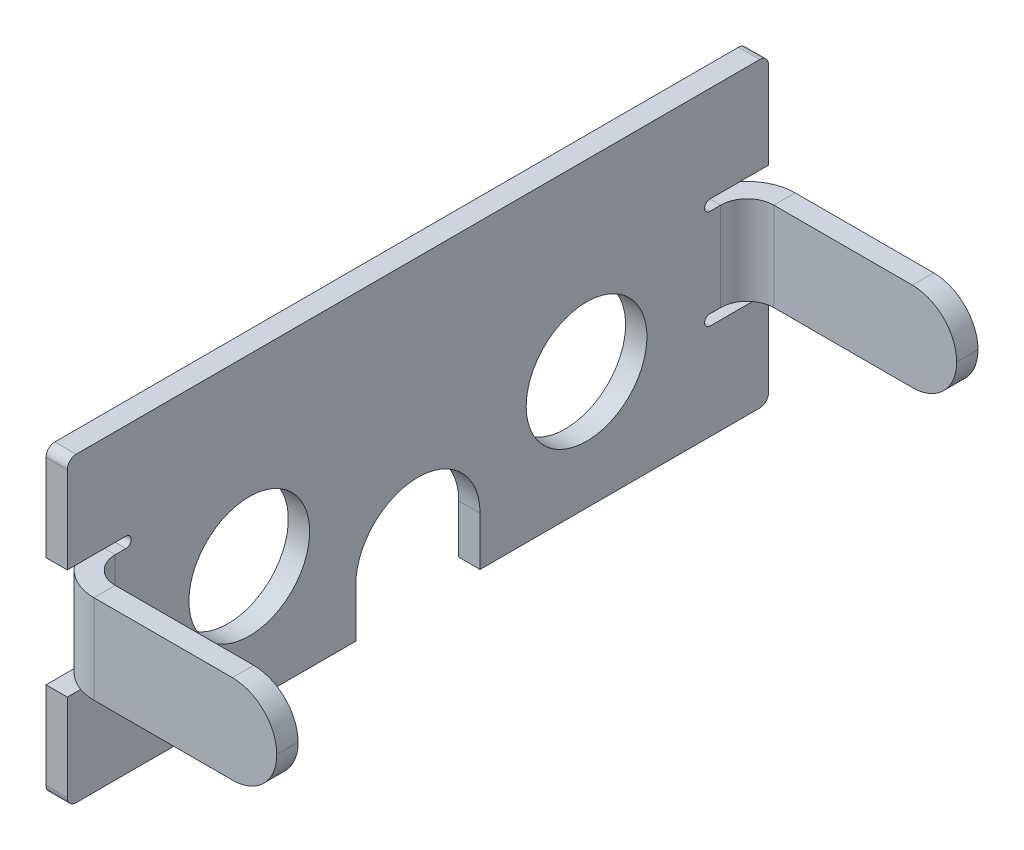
ISO-10303-21;
HEADER;
FILE_DESCRIPTION(('STEP AP214'),'2;1');
FILE_NAME('part.step','',(''),(''),'','','');
FILE_SCHEMA(('AUTOMOTIVE_DESIGN { 1 0 10303 214 1 1 1 1 }'));
ENDSEC;
DATA;
#1=APPLICATION_CONTEXT('core data for automotive mechanical design processes');
#2=APPLICATION_PROTOCOL_DEFINITION('international standard','automotive_design',2000,#1);
#3=PRODUCT_CONTEXT('',#1,'mechanical');
#4=PRODUCT('Part','Part','',(#3));
#5=PRODUCT_RELATED_PRODUCT_CATEGORY('part','',(#4));
#6=PRODUCT_DEFINITION_FORMATION('','',#4);
#7=PRODUCT_DEFINITION_CONTEXT('part definition',#1,'design');
#8=PRODUCT_DEFINITION('design','',#6,#7);
#9=PRODUCT_DEFINITION_SHAPE('','',#8);
#10=(LENGTH_UNIT() NAMED_UNIT(*) SI_UNIT(.MILLI.,.METRE.));
#11=(NAMED_UNIT(*) PLANE_ANGLE_UNIT() SI_UNIT($,.RADIAN.));
#12=(NAMED_UNIT(*) SI_UNIT($,.STERADIAN.) SOLID_ANGLE_UNIT());
#13=UNCERTAINTY_MEASURE_WITH_UNIT(LENGTH_MEASURE(1.E-05),#10,'distance_accuracy_value','');
#14=(GEOMETRIC_REPRESENTATION_CONTEXT(3) GLOBAL_UNCERTAINTY_ASSIGNED_CONTEXT((#13)) GLOBAL_UNIT_ASSIGNED_CONTEXT((#10,
#11,#12)) REPRESENTATION_CONTEXT('',''));
#15=CARTESIAN_POINT('',(0.,0.,0.));
#16=DIRECTION('',(0.,0.,1.));
#17=DIRECTION('',(1.,0.,0.));
#18=AXIS2_PLACEMENT_3D('',#15,#16,#17);
#19=CARTESIAN_POINT('',(-1.2,-8.50000000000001,19.75));
#20=DIRECTION('',(0.,-1.,0.));
#21=DIRECTION('',(0.,0.,-1.));
#22=AXIS2_PLACEMENT_3D('',#19,#20,#21);
#23=PLANE('',#22);
#24=DIRECTION('',(-1.,0.,0.));
#25=VECTOR('',#24,1.);
#26=CARTESIAN_POINT('',(-1.2,-8.50000000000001,3.5));
#27=LINE('',#26,#25);
#28=CARTESIAN_POINT('',(0.,-8.50000000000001,3.5));
#29=VERTEX_POINT('',#28);
#30=CARTESIAN_POINT('',(-1.2,-8.50000000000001,3.5));
#31=VERTEX_POINT('',#30);
#32=EDGE_CURVE('E13',#29,#31,#27,.T.);
#33=ORIENTED_EDGE('',*,*,#32,.F.);
#34=DIRECTION('',(0.,0.,-1.));
#35=VECTOR('',#34,1.);
#36=CARTESIAN_POINT('',(0.,-8.50000000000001,19.75));
#37=LINE('',#36,#35);
#38=CARTESIAN_POINT('',(0.,-8.50000000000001,19.25));
#39=VERTEX_POINT('',#38);
#40=EDGE_CURVE('E578',#39,#29,#37,.T.);
#41=ORIENTED_EDGE('',*,*,#40,.F.);
#42=DIRECTION('',(1.,0.,0.));
#43=VECTOR('',#42,1.);
#44=CARTESIAN_POINT('',(-1.2,-8.50000000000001,19.25));
#45=LINE('',#44,#43);
#46=CARTESIAN_POINT('',(-1.2,-8.50000000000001,19.25));
#47=VERTEX_POINT('',#46);
#48=EDGE_CURVE('E605',#39,#47,#45,.F.);
#49=ORIENTED_EDGE('',*,*,#48,.T.);
#50=DIRECTION('',(0.,0.,-1.));
#51=VECTOR('',#50,1.);
#52=CARTESIAN_POINT('',(-1.2,-8.50000000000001,19.75));
#53=LINE('',#52,#51);
#54=EDGE_CURVE('E565',#47,#31,#53,.T.);
#55=ORIENTED_EDGE('',*,*,#54,.T.);
#56=EDGE_LOOP('',(#33,#41,#49,#55));
#57=FACE_BOUND('',#56,.T.);
#58=ADVANCED_FACE('F76',(#57),#23,.T.);
#59=CARTESIAN_POINT('',(-1.2,0.,0.));
#60=DIRECTION('',(-1.,0.,0.));
#61=DIRECTION('',(0.,0.,1.));
#62=AXIS2_PLACEMENT_3D('',#59,#60,#61);
#63=PLANE('',#62);
#64=DIRECTION('',(0.,1.,0.));
#65=VECTOR('',#64,1.);
#66=CARTESIAN_POINT('',(-1.2,-5.75000000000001,3.5));
#67=LINE('',#66,#65);
#68=CARTESIAN_POINT('',(-1.2,-5.75000000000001,3.5));
#69=VERTEX_POINT('',#68);
#70=EDGE_CURVE('E342',#31,#69,#67,.T.);
#71=ORIENTED_EDGE('',*,*,#70,.F.);
#72=ORIENTED_EDGE('',*,*,#54,.F.);
#73=CARTESIAN_POINT('',(-1.2,-8.00000000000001,19.25));
#74=DIRECTION('',(-1.,0.,0.));
#75=DIRECTION('',(0.,0.,1.));
#76=AXIS2_PLACEMENT_3D('',#73,#74,#75);
#77=CIRCLE('',#76,0.5);
#78=CARTESIAN_POINT('',(-1.2,-8.00000000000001,19.75));
#79=VERTEX_POINT('',#78);
#80=EDGE_CURVE('E625',#47,#79,#77,.T.);
#81=ORIENTED_EDGE('',*,*,#80,.T.);
#82=DIRECTION('',(0.,-1.,0.));
#83=VECTOR('',#82,1.);
#84=CARTESIAN_POINT('',(-1.2,-8.50000000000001,19.75));
#85=LINE('',#84,#83);
#86=CARTESIAN_POINT('',(-1.2,-3.1,19.75));
#87=VERTEX_POINT('',#86);
#88=EDGE_CURVE('E561',#87,#79,#85,.T.);
#89=ORIENTED_EDGE('',*,*,#88,.F.);
#90=DIRECTION('',(0.,0.,-1.));
#91=VECTOR('',#90,1.);
#92=CARTESIAN_POINT('',(-1.2,-3.1,0.));
#93=LINE('',#92,#91);
#94=CARTESIAN_POINT('',(-1.2,-3.1,16.45));
#95=VERTEX_POINT('',#94);
#96=EDGE_CURVE('E553',#87,#95,#93,.T.);
#97=ORIENTED_EDGE('',*,*,#96,.T.);
#98=CARTESIAN_POINT('',(-1.2,-2.8,16.45));
#99=DIRECTION('',(-1.,0.,0.));
#100=DIRECTION('',(0.,0.,1.));
#101=AXIS2_PLACEMENT_3D('',#98,#99,#100);
#102=CIRCLE('',#101,0.3);
#103=CARTESIAN_POINT('',(-1.2,-2.5,16.45));
#104=VERTEX_POINT('',#103);
#105=EDGE_CURVE('E551',#95,#104,#102,.F.);
#106=ORIENTED_EDGE('',*,*,#105,.T.);
#107=DIRECTION('',(0.,0.,1.));
#108=VECTOR('',#107,1.);
#109=CARTESIAN_POINT('',(-1.2,-2.5,0.));
#110=LINE('',#109,#108);
#111=CARTESIAN_POINT('',(-1.20000000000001,-2.5,17.05));
#112=VERTEX_POINT('',#111);
#113=EDGE_CURVE('E548',#104,#112,#110,.T.);
#114=ORIENTED_EDGE('',*,*,#113,.T.);
#115=DIRECTION('',(0.,-1.,0.));
#116=VECTOR('',#115,1.);
#117=CARTESIAN_POINT('',(-1.20000000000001,-2.5,17.05));
#118=LINE('',#117,#116);
#119=CARTESIAN_POINT('',(-1.2,2.5,17.05));
#120=VERTEX_POINT('',#119);
#121=EDGE_CURVE('E484',#112,#120,#118,.F.);
#122=ORIENTED_EDGE('',*,*,#121,.T.);
#123=DIRECTION('',(0.,0.,-1.));
#124=VECTOR('',#123,1.);
#125=CARTESIAN_POINT('',(-1.2,2.5,0.));
#126=LINE('',#125,#124);
#127=CARTESIAN_POINT('',(-1.2,2.5,16.45));
#128=VERTEX_POINT('',#127);
#129=EDGE_CURVE('E546',#120,#128,#126,.T.);
#130=ORIENTED_EDGE('',*,*,#129,.T.);
#131=CARTESIAN_POINT('',(-1.2,2.8,16.45));
#132=DIRECTION('',(-1.,0.,0.));
#133=DIRECTION('',(0.,0.,1.));
#134=AXIS2_PLACEMENT_3D('',#131,#132,#133);
#135=CIRCLE('',#134,0.3);
#136=CARTESIAN_POINT('',(-1.2,3.1,16.45));
#137=VERTEX_POINT('',#136);
#138=EDGE_CURVE('E544',#128,#137,#135,.F.);
#139=ORIENTED_EDGE('',*,*,#138,.T.);
#140=DIRECTION('',(0.,0.,1.));
#141=VECTOR('',#140,1.);
#142=CARTESIAN_POINT('',(-1.2,3.1,0.));
#143=LINE('',#142,#141);
#144=CARTESIAN_POINT('',(-1.2,3.1,19.75));
#145=VERTEX_POINT('',#144);
#146=EDGE_CURVE('E510',#137,#145,#143,.T.);
#147=ORIENTED_EDGE('',*,*,#146,.T.);
#148=CARTESIAN_POINT('',(-1.2,7.99999999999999,19.75));
#149=VERTEX_POINT('',#148);
#150=EDGE_CURVE('E562',#149,#145,#85,.T.);
#151=ORIENTED_EDGE('',*,*,#150,.F.);
#152=CARTESIAN_POINT('',(-1.2,7.99999999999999,19.25));
#153=DIRECTION('',(-1.,0.,0.));
#154=DIRECTION('',(0.,0.,1.));
#155=AXIS2_PLACEMENT_3D('',#152,#153,#154);
#156=CIRCLE('',#155,0.5);
#157=CARTESIAN_POINT('',(-1.2,8.49999999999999,19.25));
#158=VERTEX_POINT('',#157);
#159=EDGE_CURVE('E99',#149,#158,#156,.T.);
#160=ORIENTED_EDGE('',*,*,#159,.T.);
#161=DIRECTION('',(0.,0.,1.));
#162=VECTOR('',#161,1.);
#163=CARTESIAN_POINT('',(-1.2,8.49999999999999,19.75));
#164=LINE('',#163,#162);
#165=CARTESIAN_POINT('',(-1.2,8.49999999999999,-19.25));
#166=VERTEX_POINT('',#165);
#167=EDGE_CURVE('E558',#166,#158,#164,.T.);
#168=ORIENTED_EDGE('',*,*,#167,.F.);
#169=CARTESIAN_POINT('',(-1.2,7.99999999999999,-19.25));
#170=DIRECTION('',(-1.,0.,0.));
#171=DIRECTION('',(0.,0.,1.));
#172=AXIS2_PLACEMENT_3D('',#169,#170,#171);
#173=CIRCLE('',#172,0.5);
#174=CARTESIAN_POINT('',(-1.2,7.99999999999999,-19.75));
#175=VERTEX_POINT('',#174);
#176=EDGE_CURVE('E627',#166,#175,#173,.T.);
#177=ORIENTED_EDGE('',*,*,#176,.T.);
#178=DIRECTION('',(0.,1.,0.));
#179=VECTOR('',#178,1.);
#180=CARTESIAN_POINT('',(-1.2,-8.50000000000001,-19.75));
#181=LINE('',#180,#179);
#182=CARTESIAN_POINT('',(-1.2,3.1,-19.75));
#183=VERTEX_POINT('',#182);
#184=EDGE_CURVE('E559',#183,#175,#181,.T.);
#185=ORIENTED_EDGE('',*,*,#184,.F.);
#186=DIRECTION('',(0.,0.,1.));
#187=VECTOR('',#186,1.);
#188=CARTESIAN_POINT('',(-1.2,3.1,0.));
#189=LINE('',#188,#187);
#190=CARTESIAN_POINT('',(-1.2,3.1,-16.45));
#191=VERTEX_POINT('',#190);
#192=EDGE_CURVE('E447',#183,#191,#189,.T.);
#193=ORIENTED_EDGE('',*,*,#192,.T.);
#194=CARTESIAN_POINT('',(-1.2,2.8,-16.45));
#195=DIRECTION('',(-1.,0.,0.));
#196=DIRECTION('',(0.,0.,1.));
#197=AXIS2_PLACEMENT_3D('',#194,#195,#196);
#198=CIRCLE('',#197,0.3);
#199=CARTESIAN_POINT('',(-1.2,2.5,-16.45));
#200=VERTEX_POINT('',#199);
#201=EDGE_CURVE('E459',#191,#200,#198,.F.);
#202=ORIENTED_EDGE('',*,*,#201,.T.);
#203=DIRECTION('',(0.,0.,-1.));
#204=VECTOR('',#203,1.);
#205=CARTESIAN_POINT('',(-1.2,2.5,0.));
#206=LINE('',#205,#204);
#207=CARTESIAN_POINT('',(-1.20000000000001,2.5,-17.05));
#208=VERTEX_POINT('',#207);
#209=EDGE_CURVE('E456',#200,#208,#206,.T.);
#210=ORIENTED_EDGE('',*,*,#209,.T.);
#211=DIRECTION('',(0.,1.,0.));
#212=VECTOR('',#211,1.);
#213=CARTESIAN_POINT('',(-1.20000000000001,2.5,-17.05));
#214=LINE('',#213,#212);
#215=CARTESIAN_POINT('',(-1.2,-2.5,-17.05));
#216=VERTEX_POINT('',#215);
#217=EDGE_CURVE('E386',#208,#216,#214,.F.);
#218=ORIENTED_EDGE('',*,*,#217,.T.);
#219=DIRECTION('',(0.,0.,1.));
#220=VECTOR('',#219,1.);
#221=CARTESIAN_POINT('',(-1.2,-2.5,0.));
#222=LINE('',#221,#220);
#223=CARTESIAN_POINT('',(-1.2,-2.5,-16.45));
#224=VERTEX_POINT('',#223);
#225=EDGE_CURVE('E453',#216,#224,#222,.T.);
#226=ORIENTED_EDGE('',*,*,#225,.T.);
#227=CARTESIAN_POINT('',(-1.2,-2.8,-16.45));
#228=DIRECTION('',(-1.,0.,0.));
#229=DIRECTION('',(0.,0.,1.));
#230=AXIS2_PLACEMENT_3D('',#227,#228,#229);
#231=CIRCLE('',#230,0.3);
#232=CARTESIAN_POINT('',(-1.2,-3.1,-16.45));
#233=VERTEX_POINT('',#232);
#234=EDGE_CURVE('E450',#224,#233,#231,.F.);
#235=ORIENTED_EDGE('',*,*,#234,.T.);
#236=DIRECTION('',(0.,0.,-1.));
#237=VECTOR('',#236,1.);
#238=CARTESIAN_POINT('',(-1.2,-3.1,0.));
#239=LINE('',#238,#237);
#240=CARTESIAN_POINT('',(-1.2,-3.1,-19.75));
#241=VERTEX_POINT('',#240);
#242=EDGE_CURVE('E412',#233,#241,#239,.T.);
#243=ORIENTED_EDGE('',*,*,#242,.T.);
#244=CARTESIAN_POINT('',(-1.2,-8.00000000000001,-19.75));
#245=VERTEX_POINT('',#244);
#246=EDGE_CURVE('E556',#245,#241,#181,.T.);
#247=ORIENTED_EDGE('',*,*,#246,.F.);
#248=CARTESIAN_POINT('',(-1.2,-8.00000000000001,-19.25));
#249=DIRECTION('',(-1.,0.,0.));
#250=DIRECTION('',(0.,0.,1.));
#251=AXIS2_PLACEMENT_3D('',#248,#249,#250);
#252=CIRCLE('',#251,0.5);
#253=CARTESIAN_POINT('',(-1.2,-8.50000000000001,-19.25));
#254=VERTEX_POINT('',#253);
#255=EDGE_CURVE('E629',#245,#254,#252,.T.);
#256=ORIENTED_EDGE('',*,*,#255,.T.);
#257=CARTESIAN_POINT('',(-1.2,-8.50000000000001,-3.5));
#258=VERTEX_POINT('',#257);
#259=EDGE_CURVE('E564',#258,#254,#53,.T.);
#260=ORIENTED_EDGE('',*,*,#259,.F.);
#261=DIRECTION('',(0.,-1.,0.));
#262=VECTOR('',#261,1.);
#263=CARTESIAN_POINT('',(-1.2,-5.75000000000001,-3.5));
#264=LINE('',#263,#262);
#265=CARTESIAN_POINT('',(-1.2,-5.75000000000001,-3.5));
#266=VERTEX_POINT('',#265);
#267=EDGE_CURVE('E91',#266,#258,#264,.T.);
#268=ORIENTED_EDGE('',*,*,#267,.F.);
#269=CARTESIAN_POINT('',(-1.2,-5.75000000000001,0.));
#270=DIRECTION('',(-1.,0.,0.));
#271=DIRECTION('',(0.,0.,1.));
#272=AXIS2_PLACEMENT_3D('',#269,#270,#271);
#273=CIRCLE('',#272,3.5);
#274=EDGE_CURVE('E330',#69,#266,#273,.T.);
#275=ORIENTED_EDGE('',*,*,#274,.F.);
#276=EDGE_LOOP('',(#71,#72,#81,#89,#97,#106,#114,#122,#130,#139,#147,#151,#160,#168,#177,#185,
#193,#202,#210,#218,#226,#235,#243,#247,#256,#260,#268,#275));
#277=FACE_BOUND('',#276,.T.);
#278=CARTESIAN_POINT('',(-1.2,-1.84493489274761,9.5));
#279=DIRECTION('',(-1.,0.,0.));
#280=DIRECTION('',(0.,0.,1.));
#281=AXIS2_PLACEMENT_3D('',#278,#279,#280);
#282=CIRCLE('',#281,3.4);
#283=CARTESIAN_POINT('',(-1.2,-1.84493489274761,12.9));
#284=VERTEX_POINT('',#283);
#285=EDGE_CURVE('E349',#284,#284,#282,.T.);
#286=ORIENTED_EDGE('',*,*,#285,.F.);
#287=EDGE_LOOP('',(#286));
#288=FACE_BOUND('',#287,.T.);
#289=CARTESIAN_POINT('',(-1.2,-1.84493489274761,-9.5));
#290=DIRECTION('',(-1.,0.,0.));
#291=DIRECTION('',(0.,0.,1.));
#292=AXIS2_PLACEMENT_3D('',#289,#290,#291);
#293=CIRCLE('',#292,3.4);
#294=CARTESIAN_POINT('',(-1.2,-1.84493489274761,-6.1));
#295=VERTEX_POINT('',#294);
#296=EDGE_CURVE('E354',#295,#295,#293,.T.);
#297=ORIENTED_EDGE('',*,*,#296,.F.);
#298=EDGE_LOOP('',(#297));
#299=FACE_BOUND('',#298,.T.);
#300=ADVANCED_FACE('F651',(#277,#288,#299),#63,.T.);
#301=CARTESIAN_POINT('',(0.,0.,0.));
#302=DIRECTION('',(-1.,0.,0.));
#303=DIRECTION('',(0.,0.,1.));
#304=AXIS2_PLACEMENT_3D('',#301,#302,#303);
#305=PLANE('',#304);
#306=CARTESIAN_POINT('',(0.,-1.84493489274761,9.5));
#307=DIRECTION('',(-1.,0.,0.));
#308=DIRECTION('',(0.,0.,1.));
#309=AXIS2_PLACEMENT_3D('',#306,#307,#308);
#310=CIRCLE('',#309,3.4);
#311=CARTESIAN_POINT('',(0.,-1.84493489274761,12.9));
#312=VERTEX_POINT('',#311);
#313=EDGE_CURVE('E351',#312,#312,#310,.T.);
#314=ORIENTED_EDGE('',*,*,#313,.T.);
#315=EDGE_LOOP('',(#314));
#316=FACE_BOUND('',#315,.T.);
#317=CARTESIAN_POINT('',(0.,-1.84493489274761,-9.5));
#318=DIRECTION('',(-1.,0.,0.));
#319=DIRECTION('',(0.,0.,1.));
#320=AXIS2_PLACEMENT_3D('',#317,#318,#319);
#321=CIRCLE('',#320,3.4);
#322=CARTESIAN_POINT('',(0.,-1.84493489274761,-6.1));
#323=VERTEX_POINT('',#322);
#324=EDGE_CURVE('E357',#323,#323,#321,.T.);
#325=ORIENTED_EDGE('',*,*,#324,.T.);
#326=EDGE_LOOP('',(#325));
#327=FACE_BOUND('',#326,.T.);
#328=ORIENTED_EDGE('',*,*,#40,.T.);
#329=DIRECTION('',(0.,1.,0.));
#330=VECTOR('',#329,1.);
#331=CARTESIAN_POINT('',(0.,-5.75000000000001,3.5));
#332=LINE('',#331,#330);
#333=CARTESIAN_POINT('',(0.,-5.75000000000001,3.5));
#334=VERTEX_POINT('',#333);
#335=EDGE_CURVE('E332',#29,#334,#332,.T.);
#336=ORIENTED_EDGE('',*,*,#335,.T.);
#337=CARTESIAN_POINT('',(0.,-5.75000000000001,0.));
#338=DIRECTION('',(-1.,0.,0.));
#339=DIRECTION('',(0.,0.,1.));
#340=AXIS2_PLACEMENT_3D('',#337,#338,#339);
#341=CIRCLE('',#340,3.5);
#342=CARTESIAN_POINT('',(0.,-5.75000000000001,-3.5));
#343=VERTEX_POINT('',#342);
#344=EDGE_CURVE('E327',#334,#343,#341,.T.);
#345=ORIENTED_EDGE('',*,*,#344,.T.);
#346=DIRECTION('',(0.,-1.,0.));
#347=VECTOR('',#346,1.);
#348=CARTESIAN_POINT('',(0.,-5.75000000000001,-3.5));
#349=LINE('',#348,#347);
#350=CARTESIAN_POINT('',(0.,-8.50000000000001,-3.5));
#351=VERTEX_POINT('',#350);
#352=EDGE_CURVE('E335',#343,#351,#349,.T.);
#353=ORIENTED_EDGE('',*,*,#352,.T.);
#354=CARTESIAN_POINT('',(0.,-8.50000000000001,-19.25));
#355=VERTEX_POINT('',#354);
#356=EDGE_CURVE('E577',#351,#355,#37,.T.);
#357=ORIENTED_EDGE('',*,*,#356,.T.);
#358=CARTESIAN_POINT('',(0.,-8.00000000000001,-19.25));
#359=DIRECTION('',(-1.,0.,0.));
#360=DIRECTION('',(0.,0.,1.));
#361=AXIS2_PLACEMENT_3D('',#358,#359,#360);
#362=CIRCLE('',#361,0.5);
#363=CARTESIAN_POINT('',(0.,-8.00000000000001,-19.75));
#364=VERTEX_POINT('',#363);
#365=EDGE_CURVE('E620',#355,#364,#362,.F.);
#366=ORIENTED_EDGE('',*,*,#365,.T.);
#367=DIRECTION('',(0.,1.,0.));
#368=VECTOR('',#367,1.);
#369=CARTESIAN_POINT('',(0.,-8.50000000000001,-19.75));
#370=LINE('',#369,#368);
#371=CARTESIAN_POINT('',(0.,-3.1,-19.75));
#372=VERTEX_POINT('',#371);
#373=EDGE_CURVE('E569',#364,#372,#370,.T.);
#374=ORIENTED_EDGE('',*,*,#373,.T.);
#375=DIRECTION('',(0.,0.,-1.));
#376=VECTOR('',#375,1.);
#377=CARTESIAN_POINT('',(0.,-3.1,-16.45));
#378=LINE('',#377,#376);
#379=CARTESIAN_POINT('',(0.,-3.1,-16.45));
#380=VERTEX_POINT('',#379);
#381=EDGE_CURVE('E429',#380,#372,#378,.T.);
#382=ORIENTED_EDGE('',*,*,#381,.F.);
#383=CARTESIAN_POINT('',(0.,-2.8,-16.45));
#384=DIRECTION('',(1.,0.,0.));
#385=DIRECTION('',(0.,0.,-1.));
#386=AXIS2_PLACEMENT_3D('',#383,#384,#385);
#387=CIRCLE('',#386,0.3);
#388=CARTESIAN_POINT('',(0.,-2.5,-16.45));
#389=VERTEX_POINT('',#388);
#390=EDGE_CURVE('E425',#389,#380,#387,.T.);
#391=ORIENTED_EDGE('',*,*,#390,.F.);
#392=DIRECTION('',(0.,0.,1.));
#393=VECTOR('',#392,1.);
#394=CARTESIAN_POINT('',(0.,-2.5,-17.05));
#395=LINE('',#394,#393);
#396=CARTESIAN_POINT('',(0.,-2.5,-17.05));
#397=VERTEX_POINT('',#396);
#398=EDGE_CURVE('E422',#397,#389,#395,.T.);
#399=ORIENTED_EDGE('',*,*,#398,.F.);
#400=DIRECTION('',(0.,1.,0.));
#401=VECTOR('',#400,1.);
#402=CARTESIAN_POINT('',(0.,2.5,-17.05));
#403=LINE('',#402,#401);
#404=CARTESIAN_POINT('',(0.,2.5,-17.05));
#405=VERTEX_POINT('',#404);
#406=EDGE_CURVE('E399',#405,#397,#403,.F.);
#407=ORIENTED_EDGE('',*,*,#406,.F.);
#408=DIRECTION('',(0.,0.,-1.));
#409=VECTOR('',#408,1.);
#410=CARTESIAN_POINT('',(0.,2.5,-16.45));
#411=LINE('',#410,#409);
#412=CARTESIAN_POINT('',(0.,2.5,-16.45));
#413=VERTEX_POINT('',#412);
#414=EDGE_CURVE('E418',#413,#405,#411,.T.);
#415=ORIENTED_EDGE('',*,*,#414,.F.);
#416=CARTESIAN_POINT('',(0.,2.8,-16.45));
#417=DIRECTION('',(1.,0.,0.));
#418=DIRECTION('',(0.,0.,-1.));
#419=AXIS2_PLACEMENT_3D('',#416,#417,#418);
#420=CIRCLE('',#419,0.3);
#421=CARTESIAN_POINT('',(0.,3.1,-16.45));
#422=VERTEX_POINT('',#421);
#423=EDGE_CURVE('E414',#422,#413,#420,.T.);
#424=ORIENTED_EDGE('',*,*,#423,.F.);
#425=DIRECTION('',(0.,0.,1.));
#426=VECTOR('',#425,1.);
#427=CARTESIAN_POINT('',(0.,3.1,-19.75));
#428=LINE('',#427,#426);
#429=CARTESIAN_POINT('',(0.,3.1,-19.75));
#430=VERTEX_POINT('',#429);
#431=EDGE_CURVE('E409',#430,#422,#428,.T.);
#432=ORIENTED_EDGE('',*,*,#431,.F.);
#433=CARTESIAN_POINT('',(0.,7.99999999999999,-19.75));
#434=VERTEX_POINT('',#433);
#435=EDGE_CURVE('E555',#430,#434,#370,.T.);
#436=ORIENTED_EDGE('',*,*,#435,.T.);
#437=CARTESIAN_POINT('',(0.,7.99999999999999,-19.25));
#438=DIRECTION('',(-1.,0.,0.));
#439=DIRECTION('',(0.,0.,1.));
#440=AXIS2_PLACEMENT_3D('',#437,#438,#439);
#441=CIRCLE('',#440,0.5);
#442=CARTESIAN_POINT('',(0.,8.49999999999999,-19.25));
#443=VERTEX_POINT('',#442);
#444=EDGE_CURVE('E618',#434,#443,#441,.F.);
#445=ORIENTED_EDGE('',*,*,#444,.T.);
#446=DIRECTION('',(0.,0.,1.));
#447=VECTOR('',#446,1.);
#448=CARTESIAN_POINT('',(0.,8.49999999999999,19.75));
#449=LINE('',#448,#447);
#450=CARTESIAN_POINT('',(0.,8.49999999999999,19.25));
#451=VERTEX_POINT('',#450);
#452=EDGE_CURVE('E571',#443,#451,#449,.T.);
#453=ORIENTED_EDGE('',*,*,#452,.T.);
#454=CARTESIAN_POINT('',(0.,7.99999999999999,19.25));
#455=DIRECTION('',(-1.,0.,0.));
#456=DIRECTION('',(0.,0.,1.));
#457=AXIS2_PLACEMENT_3D('',#454,#455,#456);
#458=CIRCLE('',#457,0.5);
#459=CARTESIAN_POINT('',(0.,7.99999999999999,19.75));
#460=VERTEX_POINT('',#459);
#461=EDGE_CURVE('E614',#451,#460,#458,.F.);
#462=ORIENTED_EDGE('',*,*,#461,.T.);
#463=DIRECTION('',(0.,-1.,0.));
#464=VECTOR('',#463,1.);
#465=CARTESIAN_POINT('',(0.,-8.50000000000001,19.75));
#466=LINE('',#465,#464);
#467=CARTESIAN_POINT('',(0.,3.1,19.75));
#468=VERTEX_POINT('',#467);
#469=EDGE_CURVE('E575',#460,#468,#466,.T.);
#470=ORIENTED_EDGE('',*,*,#469,.T.);
#471=DIRECTION('',(0.,0.,1.));
#472=VECTOR('',#471,1.);
#473=CARTESIAN_POINT('',(0.,3.1,16.45));
#474=LINE('',#473,#472);
#475=CARTESIAN_POINT('',(0.,3.1,16.45));
#476=VERTEX_POINT('',#475);
#477=EDGE_CURVE('E527',#476,#468,#474,.T.);
#478=ORIENTED_EDGE('',*,*,#477,.F.);
#479=CARTESIAN_POINT('',(0.,2.8,16.45));
#480=DIRECTION('',(1.,0.,0.));
#481=DIRECTION('',(0.,0.,-1.));
#482=AXIS2_PLACEMENT_3D('',#479,#480,#481);
#483=CIRCLE('',#482,0.3);
#484=CARTESIAN_POINT('',(0.,2.5,16.45));
#485=VERTEX_POINT('',#484);
#486=EDGE_CURVE('E523',#485,#476,#483,.T.);
#487=ORIENTED_EDGE('',*,*,#486,.F.);
#488=DIRECTION('',(0.,0.,-1.));
#489=VECTOR('',#488,1.);
#490=CARTESIAN_POINT('',(0.,2.5,17.05));
#491=LINE('',#490,#489);
#492=CARTESIAN_POINT('',(0.,2.5,17.05));
#493=VERTEX_POINT('',#492);
#494=EDGE_CURVE('E520',#493,#485,#491,.T.);
#495=ORIENTED_EDGE('',*,*,#494,.F.);
#496=DIRECTION('',(0.,-1.,0.));
#497=VECTOR('',#496,1.);
#498=CARTESIAN_POINT('',(0.,-2.5,17.05));
#499=LINE('',#498,#497);
#500=CARTESIAN_POINT('',(0.,-2.5,17.05));
#501=VERTEX_POINT('',#500);
#502=EDGE_CURVE('E497',#501,#493,#499,.F.);
#503=ORIENTED_EDGE('',*,*,#502,.F.);
#504=DIRECTION('',(0.,0.,1.));
#505=VECTOR('',#504,1.);
#506=CARTESIAN_POINT('',(0.,-2.5,16.45));
#507=LINE('',#506,#505);
#508=CARTESIAN_POINT('',(0.,-2.5,16.45));
#509=VERTEX_POINT('',#508);
#510=EDGE_CURVE('E516',#509,#501,#507,.T.);
#511=ORIENTED_EDGE('',*,*,#510,.F.);
#512=CARTESIAN_POINT('',(0.,-2.8,16.45));
#513=DIRECTION('',(1.,0.,0.));
#514=DIRECTION('',(0.,0.,-1.));
#515=AXIS2_PLACEMENT_3D('',#512,#513,#514);
#516=CIRCLE('',#515,0.3);
#517=CARTESIAN_POINT('',(0.,-3.1,16.45));
#518=VERTEX_POINT('',#517);
#519=EDGE_CURVE('E512',#518,#509,#516,.T.);
#520=ORIENTED_EDGE('',*,*,#519,.F.);
#521=DIRECTION('',(0.,0.,-1.));
#522=VECTOR('',#521,1.);
#523=CARTESIAN_POINT('',(0.,-3.1,19.75));
#524=LINE('',#523,#522);
#525=CARTESIAN_POINT('',(0.,-3.1,19.75));
#526=VERTEX_POINT('',#525);
#527=EDGE_CURVE('E507',#526,#518,#524,.T.);
#528=ORIENTED_EDGE('',*,*,#527,.F.);
#529=CARTESIAN_POINT('',(0.,-8.00000000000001,19.75));
#530=VERTEX_POINT('',#529);
#531=EDGE_CURVE('E574',#526,#530,#466,.T.);
#532=ORIENTED_EDGE('',*,*,#531,.T.);
#533=CARTESIAN_POINT('',(0.,-8.00000000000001,19.25));
#534=DIRECTION('',(-1.,0.,0.));
#535=DIRECTION('',(0.,0.,1.));
#536=AXIS2_PLACEMENT_3D('',#533,#534,#535);
#537=CIRCLE('',#536,0.5);
#538=EDGE_CURVE('E616',#530,#39,#537,.F.);
#539=ORIENTED_EDGE('',*,*,#538,.T.);
#540=EDGE_LOOP('',(#328,#336,#345,#353,#357,#366,#374,#382,#391,#399,#407,#415,#424,#432,#436,
#445,#453,#462,#470,#478,#487,#495,#503,#511,#520,#528,#532,#539));
#541=FACE_BOUND('',#540,.T.);
#542=ADVANCED_FACE('F341',(#316,#327,#541),#305,.F.);
#543=CARTESIAN_POINT('',(-1.2,-8.50000000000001,-19.75));
#544=DIRECTION('',(0.,0.,-1.));
#545=DIRECTION('',(-1.,0.,0.));
#546=AXIS2_PLACEMENT_3D('',#543,#544,#545);
#547=PLANE('',#546);
#548=ORIENTED_EDGE('',*,*,#184,.T.);
#549=DIRECTION('',(1.,0.,0.));
#550=VECTOR('',#549,1.);
#551=CARTESIAN_POINT('',(-1.2,7.99999999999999,-19.75));
#552=LINE('',#551,#550);
#553=EDGE_CURVE('E632',#175,#434,#552,.T.);
#554=ORIENTED_EDGE('',*,*,#553,.T.);
#555=ORIENTED_EDGE('',*,*,#435,.F.);
#556=DIRECTION('',(-1.,0.,0.));
#557=VECTOR('',#556,1.);
#558=CARTESIAN_POINT('',(0.,3.1,-19.75));
#559=LINE('',#558,#557);
#560=EDGE_CURVE('E413',#430,#183,#559,.T.);
#561=ORIENTED_EDGE('',*,*,#560,.T.);
#562=EDGE_LOOP('',(#548,#554,#555,#561));
#563=FACE_BOUND('',#562,.T.);
#564=ADVANCED_FACE('F668',(#563),#547,.T.);
#565=ORIENTED_EDGE('',*,*,#373,.F.);
#566=DIRECTION('',(1.,0.,0.));
#567=VECTOR('',#566,1.);
#568=CARTESIAN_POINT('',(-1.2,-8.00000000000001,-19.75));
#569=LINE('',#568,#567);
#570=EDGE_CURVE('E622',#364,#245,#569,.F.);
#571=ORIENTED_EDGE('',*,*,#570,.T.);
#572=ORIENTED_EDGE('',*,*,#246,.T.);
#573=DIRECTION('',(-1.,0.,0.));
#574=VECTOR('',#573,1.);
#575=CARTESIAN_POINT('',(0.,-3.1,-19.75));
#576=LINE('',#575,#574);
#577=EDGE_CURVE('E432',#372,#241,#576,.T.);
#578=ORIENTED_EDGE('',*,*,#577,.F.);
#579=EDGE_LOOP('',(#565,#571,#572,#578));
#580=FACE_BOUND('',#579,.T.);
#581=ADVANCED_FACE('F731',(#580),#547,.T.);
#582=CARTESIAN_POINT('',(-1.2,-8.50000000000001,19.75));
#583=DIRECTION('',(0.,0.,1.));
#584=DIRECTION('',(1.,0.,0.));
#585=AXIS2_PLACEMENT_3D('',#582,#583,#584);
#586=PLANE('',#585);
#587=ORIENTED_EDGE('',*,*,#88,.T.);
#588=DIRECTION('',(1.,0.,0.));
#589=VECTOR('',#588,1.);
#590=CARTESIAN_POINT('',(-1.2,-8.00000000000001,19.75));
#591=LINE('',#590,#589);
#592=EDGE_CURVE('E640',#79,#530,#591,.T.);
#593=ORIENTED_EDGE('',*,*,#592,.T.);
#594=ORIENTED_EDGE('',*,*,#531,.F.);
#595=DIRECTION('',(-1.,0.,0.));
#596=VECTOR('',#595,1.);
#597=CARTESIAN_POINT('',(0.,-3.1,19.75));
#598=LINE('',#597,#596);
#599=EDGE_CURVE('E511',#526,#87,#598,.T.);
#600=ORIENTED_EDGE('',*,*,#599,.T.);
#601=EDGE_LOOP('',(#587,#593,#594,#600));
#602=FACE_BOUND('',#601,.T.);
#603=ADVANCED_FACE('F748',(#602),#586,.T.);
#604=ORIENTED_EDGE('',*,*,#469,.F.);
#605=DIRECTION('',(1.,0.,0.));
#606=VECTOR('',#605,1.);
#607=CARTESIAN_POINT('',(-1.2,7.99999999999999,19.75));
#608=LINE('',#607,#606);
#609=EDGE_CURVE('E643',#460,#149,#608,.F.);
#610=ORIENTED_EDGE('',*,*,#609,.T.);
#611=ORIENTED_EDGE('',*,*,#150,.T.);
#612=DIRECTION('',(-1.,0.,0.));
#613=VECTOR('',#612,1.);
#614=CARTESIAN_POINT('',(0.,3.1,19.75));
#615=LINE('',#614,#613);
#616=EDGE_CURVE('E530',#468,#145,#615,.T.);
#617=ORIENTED_EDGE('',*,*,#616,.F.);
#618=EDGE_LOOP('',(#604,#610,#611,#617));
#619=FACE_BOUND('',#618,.T.);
#620=ADVANCED_FACE('F647',(#619),#586,.T.);
#621=DIRECTION('',(1.,0.,0.));
#622=VECTOR('',#621,1.);
#623=CARTESIAN_POINT('',(-1.2,-8.50000000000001,-3.5));
#624=LINE('',#623,#622);
#625=EDGE_CURVE('E84',#258,#351,#624,.T.);
#626=ORIENTED_EDGE('',*,*,#625,.F.);
#627=ORIENTED_EDGE('',*,*,#259,.T.);
#628=DIRECTION('',(1.,0.,0.));
#629=VECTOR('',#628,1.);
#630=CARTESIAN_POINT('',(-1.2,-8.50000000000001,-19.25));
#631=LINE('',#630,#629);
#632=EDGE_CURVE('E611',#254,#355,#631,.T.);
#633=ORIENTED_EDGE('',*,*,#632,.T.);
#634=ORIENTED_EDGE('',*,*,#356,.F.);
#635=EDGE_LOOP('',(#626,#627,#633,#634));
#636=FACE_BOUND('',#635,.T.);
#637=ADVANCED_FACE('F739',(#636),#23,.T.);
#638=CARTESIAN_POINT('',(-1.2,8.49999999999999,19.75));
#639=DIRECTION('',(0.,1.,0.));
#640=DIRECTION('',(0.,0.,1.));
#641=AXIS2_PLACEMENT_3D('',#638,#639,#640);
#642=PLANE('',#641);
#643=ORIENTED_EDGE('',*,*,#452,.F.);
#644=DIRECTION('',(1.,0.,0.));
#645=VECTOR('',#644,1.);
#646=CARTESIAN_POINT('',(-1.2,8.49999999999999,-19.25));
#647=LINE('',#646,#645);
#648=EDGE_CURVE('E638',#443,#166,#647,.F.);
#649=ORIENTED_EDGE('',*,*,#648,.T.);
#650=ORIENTED_EDGE('',*,*,#167,.T.);
#651=DIRECTION('',(1.,0.,0.));
#652=VECTOR('',#651,1.);
#653=CARTESIAN_POINT('',(-1.2,8.49999999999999,19.25));
#654=LINE('',#653,#652);
#655=EDGE_CURVE('E635',#158,#451,#654,.T.);
#656=ORIENTED_EDGE('',*,*,#655,.T.);
#657=EDGE_LOOP('',(#643,#649,#650,#656));
#658=FACE_BOUND('',#657,.T.);
#659=ADVANCED_FACE('F657',(#658),#642,.T.);
#660=CARTESIAN_POINT('',(0.,-3.1,19.75));
#661=DIRECTION('',(0.,1.,0.));
#662=DIRECTION('',(0.,0.,1.));
#663=AXIS2_PLACEMENT_3D('',#660,#661,#662);
#664=PLANE('',#663);
#665=ORIENTED_EDGE('',*,*,#96,.F.);
#666=ORIENTED_EDGE('',*,*,#599,.F.);
#667=ORIENTED_EDGE('',*,*,#527,.T.);
#668=DIRECTION('',(-1.,0.,0.));
#669=VECTOR('',#668,1.);
#670=CARTESIAN_POINT('',(0.,-3.1,16.45));
#671=LINE('',#670,#669);
#672=EDGE_CURVE('E515',#518,#95,#671,.T.);
#673=ORIENTED_EDGE('',*,*,#672,.T.);
#674=EDGE_LOOP('',(#665,#666,#667,#673));
#675=FACE_BOUND('',#674,.T.);
#676=ADVANCED_FACE('F746',(#675),#664,.T.);
#677=CARTESIAN_POINT('',(0.,-2.8,16.45));
#678=DIRECTION('',(-1.,0.,0.));
#679=DIRECTION('',(0.,0.,1.));
#680=AXIS2_PLACEMENT_3D('',#677,#678,#679);
#681=CYLINDRICAL_SURFACE('',#680,0.3);
#682=ORIENTED_EDGE('',*,*,#105,.F.);
#683=ORIENTED_EDGE('',*,*,#672,.F.);
#684=ORIENTED_EDGE('',*,*,#519,.T.);
#685=DIRECTION('',(-1.,0.,0.));
#686=VECTOR('',#685,1.);
#687=CARTESIAN_POINT('',(0.,-2.5,16.45));
#688=LINE('',#687,#686);
#689=EDGE_CURVE('E519',#509,#104,#688,.T.);
#690=ORIENTED_EDGE('',*,*,#689,.T.);
#691=EDGE_LOOP('',(#682,#683,#684,#690));
#692=FACE_BOUND('',#691,.T.);
#693=ADVANCED_FACE('F777',(#692),#681,.F.);
#694=CARTESIAN_POINT('',(0.,-2.5,16.45));
#695=DIRECTION('',(0.,-1.,0.));
#696=DIRECTION('',(0.,0.,-1.));
#697=AXIS2_PLACEMENT_3D('',#694,#695,#696);
#698=PLANE('',#697);
#699=ORIENTED_EDGE('',*,*,#113,.F.);
#700=ORIENTED_EDGE('',*,*,#689,.F.);
#701=ORIENTED_EDGE('',*,*,#510,.T.);
#702=DIRECTION('',(-1.,0.,0.));
#703=VECTOR('',#702,1.);
#704=CARTESIAN_POINT('',(0.,-2.5,17.05));
#705=LINE('',#704,#703);
#706=EDGE_CURVE('E491',#501,#112,#705,.T.);
#707=ORIENTED_EDGE('',*,*,#706,.T.);
#708=EDGE_LOOP('',(#699,#700,#701,#707));
#709=FACE_BOUND('',#708,.T.);
#710=ADVANCED_FACE('F781',(#709),#698,.T.);
#711=CARTESIAN_POINT('',(0.,2.5,17.05));
#712=DIRECTION('',(0.,1.,0.));
#713=DIRECTION('',(0.,0.,1.));
#714=AXIS2_PLACEMENT_3D('',#711,#712,#713);
#715=PLANE('',#714);
#716=ORIENTED_EDGE('',*,*,#129,.F.);
#717=DIRECTION('',(-1.,0.,0.));
#718=VECTOR('',#717,1.);
#719=CARTESIAN_POINT('',(0.,2.5,17.05));
#720=LINE('',#719,#718);
#721=EDGE_CURVE('E501',#493,#120,#720,.T.);
#722=ORIENTED_EDGE('',*,*,#721,.F.);
#723=ORIENTED_EDGE('',*,*,#494,.T.);
#724=DIRECTION('',(-1.,0.,0.));
#725=VECTOR('',#724,1.);
#726=CARTESIAN_POINT('',(0.,2.5,16.45));
#727=LINE('',#726,#725);
#728=EDGE_CURVE('E526',#485,#128,#727,.T.);
#729=ORIENTED_EDGE('',*,*,#728,.T.);
#730=EDGE_LOOP('',(#716,#722,#723,#729));
#731=FACE_BOUND('',#730,.T.);
#732=ADVANCED_FACE('F797',(#731),#715,.T.);
#733=CARTESIAN_POINT('',(0.,2.8,16.45));
#734=DIRECTION('',(-1.,0.,0.));
#735=DIRECTION('',(0.,0.,1.));
#736=AXIS2_PLACEMENT_3D('',#733,#734,#735);
#737=CYLINDRICAL_SURFACE('',#736,0.3);
#738=ORIENTED_EDGE('',*,*,#138,.F.);
#739=ORIENTED_EDGE('',*,*,#728,.F.);
#740=ORIENTED_EDGE('',*,*,#486,.T.);
#741=DIRECTION('',(-1.,0.,0.));
#742=VECTOR('',#741,1.);
#743=CARTESIAN_POINT('',(0.,3.1,16.45));
#744=LINE('',#743,#742);
#745=EDGE_CURVE('E504',#476,#137,#744,.T.);
#746=ORIENTED_EDGE('',*,*,#745,.T.);
#747=EDGE_LOOP('',(#738,#739,#740,#746));
#748=FACE_BOUND('',#747,.T.);
#749=ADVANCED_FACE('F905',(#748),#737,.F.);
#750=CARTESIAN_POINT('',(0.,3.1,16.45));
#751=DIRECTION('',(0.,-1.,0.));
#752=DIRECTION('',(0.,0.,-1.));
#753=AXIS2_PLACEMENT_3D('',#750,#751,#752);
#754=PLANE('',#753);
#755=ORIENTED_EDGE('',*,*,#146,.F.);
#756=ORIENTED_EDGE('',*,*,#745,.F.);
#757=ORIENTED_EDGE('',*,*,#477,.T.);
#758=ORIENTED_EDGE('',*,*,#616,.T.);
#759=EDGE_LOOP('',(#755,#756,#757,#758));
#760=FACE_BOUND('',#759,.T.);
#761=ADVANCED_FACE('F900',(#760),#754,.T.);
#762=CARTESIAN_POINT('',(1.49999999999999,2.5,17.05));
#763=DIRECTION('',(0.,1.,0.));
#764=DIRECTION('',(0.,0.,1.));
#765=AXIS2_PLACEMENT_3D('',#762,#763,#764);
#766=PLANE('',#765);
#767=DIRECTION('',(0.,0.,1.));
#768=VECTOR('',#767,1.);
#769=CARTESIAN_POINT('',(1.49999999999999,2.5,19.75));
#770=LINE('',#769,#768);
#771=CARTESIAN_POINT('',(1.49999999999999,2.5,18.55));
#772=VERTEX_POINT('',#771);
#773=CARTESIAN_POINT('',(1.49999999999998,2.5,19.75));
#774=VERTEX_POINT('',#773);
#775=EDGE_CURVE('E462',#772,#774,#770,.T.);
#776=ORIENTED_EDGE('',*,*,#775,.F.);
#777=CARTESIAN_POINT('',(1.49999999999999,2.5,17.05));
#778=DIRECTION('',(0.,-1.,0.));
#779=DIRECTION('',(0.,0.,-1.));
#780=AXIS2_PLACEMENT_3D('',#777,#778,#779);
#781=CIRCLE('',#780,1.5);
#782=EDGE_CURVE('E494',#493,#772,#781,.F.);
#783=ORIENTED_EDGE('',*,*,#782,.F.);
#784=ORIENTED_EDGE('',*,*,#721,.T.);
#785=CARTESIAN_POINT('',(1.49999999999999,2.5,17.05));
#786=DIRECTION('',(0.,-1.,0.));
#787=DIRECTION('',(0.,0.,-1.));
#788=AXIS2_PLACEMENT_3D('',#785,#786,#787);
#789=CIRCLE('',#788,2.7);
#790=EDGE_CURVE('E487',#120,#774,#789,.F.);
#791=ORIENTED_EDGE('',*,*,#790,.T.);
#792=EDGE_LOOP('',(#776,#783,#784,#791));
#793=FACE_BOUND('',#792,.T.);
#794=ADVANCED_FACE('F799',(#793),#766,.T.);
#795=CARTESIAN_POINT('',(1.49999999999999,-2.5,17.05));
#796=DIRECTION('',(0.,1.,0.));
#797=DIRECTION('',(0.,0.,1.));
#798=AXIS2_PLACEMENT_3D('',#795,#796,#797);
#799=PLANE('',#798);
#800=CARTESIAN_POINT('',(1.49999999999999,-2.5,17.05));
#801=DIRECTION('',(0.,-1.,0.));
#802=DIRECTION('',(0.,0.,-1.));
#803=AXIS2_PLACEMENT_3D('',#800,#801,#802);
#804=CIRCLE('',#803,1.5);
#805=CARTESIAN_POINT('',(1.49999999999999,-2.5,18.55));
#806=VERTEX_POINT('',#805);
#807=EDGE_CURVE('E465',#806,#501,#804,.T.);
#808=ORIENTED_EDGE('',*,*,#807,.F.);
#809=DIRECTION('',(0.,0.,1.));
#810=VECTOR('',#809,1.);
#811=CARTESIAN_POINT('',(1.49999999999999,-2.5,18.55));
#812=LINE('',#811,#810);
#813=CARTESIAN_POINT('',(1.49999999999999,-2.5,19.75));
#814=VERTEX_POINT('',#813);
#815=EDGE_CURVE('E476',#806,#814,#812,.T.);
#816=ORIENTED_EDGE('',*,*,#815,.T.);
#817=CARTESIAN_POINT('',(1.49999999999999,-2.5,17.05));
#818=DIRECTION('',(0.,-1.,0.));
#819=DIRECTION('',(0.,0.,-1.));
#820=AXIS2_PLACEMENT_3D('',#817,#818,#819);
#821=CIRCLE('',#820,2.7);
#822=EDGE_CURVE('E488',#814,#112,#821,.T.);
#823=ORIENTED_EDGE('',*,*,#822,.T.);
#824=ORIENTED_EDGE('',*,*,#706,.F.);
#825=EDGE_LOOP('',(#808,#816,#823,#824));
#826=FACE_BOUND('',#825,.T.);
#827=ADVANCED_FACE('F784',(#826),#799,.F.);
#828=CARTESIAN_POINT('',(1.49999999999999,-2.5,17.05));
#829=DIRECTION('',(0.,-1.,0.));
#830=DIRECTION('',(0.,0.,1.));
#831=AXIS2_PLACEMENT_3D('',#828,#829,#830);
#832=CYLINDRICAL_SURFACE('',#831,2.7);
#833=ORIENTED_EDGE('',*,*,#121,.F.);
#834=ORIENTED_EDGE('',*,*,#822,.F.);
#835=DIRECTION('',(0.,-1.,0.));
#836=VECTOR('',#835,1.);
#837=CARTESIAN_POINT('',(1.49999999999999,2.5,19.75));
#838=LINE('',#837,#836);
#839=EDGE_CURVE('E474',#814,#774,#838,.F.);
#840=ORIENTED_EDGE('',*,*,#839,.T.);
#841=ORIENTED_EDGE('',*,*,#790,.F.);
#842=EDGE_LOOP('',(#833,#834,#840,#841));
#843=FACE_BOUND('',#842,.T.);
#844=ADVANCED_FACE('F802',(#843),#832,.T.);
#845=CARTESIAN_POINT('',(1.49999999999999,-2.5,17.05));
#846=DIRECTION('',(0.,-1.,0.));
#847=DIRECTION('',(0.,0.,1.));
#848=AXIS2_PLACEMENT_3D('',#845,#846,#847);
#849=CYLINDRICAL_SURFACE('',#848,1.5);
#850=ORIENTED_EDGE('',*,*,#502,.T.);
#851=ORIENTED_EDGE('',*,*,#782,.T.);
#852=DIRECTION('',(0.,-1.,0.));
#853=VECTOR('',#852,1.);
#854=CARTESIAN_POINT('',(1.49999999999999,2.5,18.55));
#855=LINE('',#854,#853);
#856=EDGE_CURVE('E479',#772,#806,#855,.T.);
#857=ORIENTED_EDGE('',*,*,#856,.T.);
#858=ORIENTED_EDGE('',*,*,#807,.T.);
#859=EDGE_LOOP('',(#850,#851,#857,#858));
#860=FACE_BOUND('',#859,.T.);
#861=ADVANCED_FACE('F789',(#860),#849,.F.);
#862=CARTESIAN_POINT('',(11.8,-2.5,19.75));
#863=DIRECTION('',(0.,-1.,0.));
#864=DIRECTION('',(0.,0.,-1.));
#865=AXIS2_PLACEMENT_3D('',#862,#863,#864);
#866=PLANE('',#865);
#867=DIRECTION('',(-1.,0.,0.));
#868=VECTOR('',#867,1.);
#869=CARTESIAN_POINT('',(0.,-2.5,18.55));
#870=LINE('',#869,#868);
#871=CARTESIAN_POINT('',(9.3,-2.5,18.55));
#872=VERTEX_POINT('',#871);
#873=EDGE_CURVE('E469',#872,#806,#870,.T.);
#874=ORIENTED_EDGE('',*,*,#873,.F.);
#875=DIRECTION('',(0.,0.,-1.));
#876=VECTOR('',#875,1.);
#877=CARTESIAN_POINT('',(9.3,-2.5,19.75));
#878=LINE('',#877,#876);
#879=CARTESIAN_POINT('',(9.3,-2.5,19.75));
#880=VERTEX_POINT('',#879);
#881=EDGE_CURVE('E594',#872,#880,#878,.F.);
#882=ORIENTED_EDGE('',*,*,#881,.T.);
#883=DIRECTION('',(1.,0.,0.));
#884=VECTOR('',#883,1.);
#885=CARTESIAN_POINT('',(11.8,-2.5,19.75));
#886=LINE('',#885,#884);
#887=EDGE_CURVE('E463',#880,#814,#886,.F.);
#888=ORIENTED_EDGE('',*,*,#887,.T.);
#889=ORIENTED_EDGE('',*,*,#815,.F.);
#890=EDGE_LOOP('',(#874,#882,#888,#889));
#891=FACE_BOUND('',#890,.T.);
#892=ADVANCED_FACE('F823',(#891),#866,.T.);
#893=CARTESIAN_POINT('',(0.,2.5,19.75));
#894=DIRECTION('',(0.,1.,0.));
#895=DIRECTION('',(0.,0.,1.));
#896=AXIS2_PLACEMENT_3D('',#893,#894,#895);
#897=PLANE('',#896);
#898=DIRECTION('',(-1.,0.,0.));
#899=VECTOR('',#898,1.);
#900=CARTESIAN_POINT('',(0.,2.5,19.75));
#901=LINE('',#900,#899);
#902=CARTESIAN_POINT('',(9.3,2.5,19.75));
#903=VERTEX_POINT('',#902);
#904=EDGE_CURVE('E466',#774,#903,#901,.F.);
#905=ORIENTED_EDGE('',*,*,#904,.T.);
#906=DIRECTION('',(0.,0.,-1.));
#907=VECTOR('',#906,1.);
#908=CARTESIAN_POINT('',(9.3,2.5,19.75));
#909=LINE('',#908,#907);
#910=CARTESIAN_POINT('',(9.3,2.5,18.55));
#911=VERTEX_POINT('',#910);
#912=EDGE_CURVE('E603',#903,#911,#909,.T.);
#913=ORIENTED_EDGE('',*,*,#912,.T.);
#914=DIRECTION('',(1.,0.,0.));
#915=VECTOR('',#914,1.);
#916=CARTESIAN_POINT('',(0.,2.5,18.55));
#917=LINE('',#916,#915);
#918=EDGE_CURVE('E471',#772,#911,#917,.T.);
#919=ORIENTED_EDGE('',*,*,#918,.F.);
#920=ORIENTED_EDGE('',*,*,#775,.T.);
#921=EDGE_LOOP('',(#905,#913,#919,#920));
#922=FACE_BOUND('',#921,.T.);
#923=ADVANCED_FACE('F811',(#922),#897,.T.);
#924=CARTESIAN_POINT('',(0.,0.,19.75));
#925=DIRECTION('',(0.,0.,-1.));
#926=DIRECTION('',(-1.,0.,0.));
#927=AXIS2_PLACEMENT_3D('',#924,#925,#926);
#928=PLANE('',#927);
#929=ORIENTED_EDGE('',*,*,#887,.F.);
#930=CARTESIAN_POINT('',(9.3,0.,19.75));
#931=DIRECTION('',(0.,0.,-1.));
#932=DIRECTION('',(-1.,0.,0.));
#933=AXIS2_PLACEMENT_3D('',#930,#931,#932);
#934=CIRCLE('',#933,2.5);
#935=CARTESIAN_POINT('',(11.8,0.,19.75));
#936=VERTEX_POINT('',#935);
#937=EDGE_CURVE('E599',#880,#936,#934,.F.);
#938=ORIENTED_EDGE('',*,*,#937,.T.);
#939=CARTESIAN_POINT('',(9.3,0.,19.75));
#940=DIRECTION('',(0.,0.,-1.));
#941=DIRECTION('',(-1.,0.,0.));
#942=AXIS2_PLACEMENT_3D('',#939,#940,#941);
#943=CIRCLE('',#942,2.5);
#944=EDGE_CURVE('E597',#936,#903,#943,.F.);
#945=ORIENTED_EDGE('',*,*,#944,.T.);
#946=ORIENTED_EDGE('',*,*,#904,.F.);
#947=ORIENTED_EDGE('',*,*,#839,.F.);
#948=EDGE_LOOP('',(#929,#938,#945,#946,#947));
#949=FACE_BOUND('',#948,.T.);
#950=ADVANCED_FACE('F807',(#949),#928,.F.);
#951=CARTESIAN_POINT('',(0.,0.,18.55));
#952=DIRECTION('',(0.,0.,-1.));
#953=DIRECTION('',(-1.,0.,0.));
#954=AXIS2_PLACEMENT_3D('',#951,#952,#953);
#955=PLANE('',#954);
#956=CARTESIAN_POINT('',(9.3,0.,18.55));
#957=DIRECTION('',(0.,0.,-1.));
#958=DIRECTION('',(-1.,0.,0.));
#959=AXIS2_PLACEMENT_3D('',#956,#957,#958);
#960=CIRCLE('',#959,2.5);
#961=CARTESIAN_POINT('',(11.8,0.,18.5500000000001));
#962=VERTEX_POINT('',#961);
#963=EDGE_CURVE('E590',#911,#962,#960,.T.);
#964=ORIENTED_EDGE('',*,*,#963,.T.);
#965=CARTESIAN_POINT('',(9.3,0.,18.55));
#966=DIRECTION('',(0.,0.,-1.));
#967=DIRECTION('',(-1.,0.,0.));
#968=AXIS2_PLACEMENT_3D('',#965,#966,#967);
#969=CIRCLE('',#968,2.5);
#970=EDGE_CURVE('E592',#962,#872,#969,.T.);
#971=ORIENTED_EDGE('',*,*,#970,.T.);
#972=ORIENTED_EDGE('',*,*,#873,.T.);
#973=ORIENTED_EDGE('',*,*,#856,.F.);
#974=ORIENTED_EDGE('',*,*,#918,.T.);
#975=EDGE_LOOP('',(#964,#971,#972,#973,#974));
#976=FACE_BOUND('',#975,.T.);
#977=ADVANCED_FACE('F819',(#976),#955,.T.);
#978=CARTESIAN_POINT('',(0.,3.1,-19.75));
#979=DIRECTION('',(0.,-1.,0.));
#980=DIRECTION('',(0.,0.,-1.));
#981=AXIS2_PLACEMENT_3D('',#978,#979,#980);
#982=PLANE('',#981);
#983=ORIENTED_EDGE('',*,*,#192,.F.);
#984=ORIENTED_EDGE('',*,*,#560,.F.);
#985=ORIENTED_EDGE('',*,*,#431,.T.);
#986=DIRECTION('',(-1.,0.,0.));
#987=VECTOR('',#986,1.);
#988=CARTESIAN_POINT('',(0.,3.1,-16.45));
#989=LINE('',#988,#987);
#990=EDGE_CURVE('E417',#422,#191,#989,.T.);
#991=ORIENTED_EDGE('',*,*,#990,.T.);
#992=EDGE_LOOP('',(#983,#984,#985,#991));
#993=FACE_BOUND('',#992,.T.);
#994=ADVANCED_FACE('F671',(#993),#982,.T.);
#995=CARTESIAN_POINT('',(0.,2.8,-16.45));
#996=DIRECTION('',(-1.,0.,0.));
#997=DIRECTION('',(0.,0.,1.));
#998=AXIS2_PLACEMENT_3D('',#995,#996,#997);
#999=CYLINDRICAL_SURFACE('',#998,0.3);
#1000=ORIENTED_EDGE('',*,*,#201,.F.);
#1001=ORIENTED_EDGE('',*,*,#990,.F.);
#1002=ORIENTED_EDGE('',*,*,#423,.T.);
#1003=DIRECTION('',(-1.,0.,0.));
#1004=VECTOR('',#1003,1.);
#1005=CARTESIAN_POINT('',(0.,2.5,-16.45));
#1006=LINE('',#1005,#1004);
#1007=EDGE_CURVE('E421',#413,#200,#1006,.T.);
#1008=ORIENTED_EDGE('',*,*,#1007,.T.);
#1009=EDGE_LOOP('',(#1000,#1001,#1002,#1008));
#1010=FACE_BOUND('',#1009,.T.);
#1011=ADVANCED_FACE('F674',(#1010),#999,.F.);
#1012=CARTESIAN_POINT('',(0.,2.5,-16.45));
#1013=DIRECTION('',(0.,1.,0.));
#1014=DIRECTION('',(0.,0.,1.));
#1015=AXIS2_PLACEMENT_3D('',#1012,#1013,#1014);
#1016=PLANE('',#1015);
#1017=ORIENTED_EDGE('',*,*,#209,.F.);
#1018=ORIENTED_EDGE('',*,*,#1007,.F.);
#1019=ORIENTED_EDGE('',*,*,#414,.T.);
#1020=DIRECTION('',(-1.,0.,0.));
#1021=VECTOR('',#1020,1.);
#1022=CARTESIAN_POINT('',(0.,2.5,-17.05));
#1023=LINE('',#1022,#1021);
#1024=EDGE_CURVE('E393',#405,#208,#1023,.T.);
#1025=ORIENTED_EDGE('',*,*,#1024,.T.);
#1026=EDGE_LOOP('',(#1017,#1018,#1019,#1025));
#1027=FACE_BOUND('',#1026,.T.);
#1028=ADVANCED_FACE('F677',(#1027),#1016,.T.);
#1029=CARTESIAN_POINT('',(0.,-2.5,-17.05));
#1030=DIRECTION('',(0.,-1.,0.));
#1031=DIRECTION('',(0.,0.,-1.));
#1032=AXIS2_PLACEMENT_3D('',#1029,#1030,#1031);
#1033=PLANE('',#1032);
#1034=ORIENTED_EDGE('',*,*,#225,.F.);
#1035=DIRECTION('',(-1.,0.,0.));
#1036=VECTOR('',#1035,1.);
#1037=CARTESIAN_POINT('',(0.,-2.5,-17.05));
#1038=LINE('',#1037,#1036);
#1039=EDGE_CURVE('E403',#397,#216,#1038,.T.);
#1040=ORIENTED_EDGE('',*,*,#1039,.F.);
#1041=ORIENTED_EDGE('',*,*,#398,.T.);
#1042=DIRECTION('',(-1.,0.,0.));
#1043=VECTOR('',#1042,1.);
#1044=CARTESIAN_POINT('',(0.,-2.5,-16.45));
#1045=LINE('',#1044,#1043);
#1046=EDGE_CURVE('E428',#389,#224,#1045,.T.);
#1047=ORIENTED_EDGE('',*,*,#1046,.T.);
#1048=EDGE_LOOP('',(#1034,#1040,#1041,#1047));
#1049=FACE_BOUND('',#1048,.T.);
#1050=ADVANCED_FACE('F721',(#1049),#1033,.T.);
#1051=CARTESIAN_POINT('',(0.,-2.8,-16.45));
#1052=DIRECTION('',(-1.,0.,0.));
#1053=DIRECTION('',(0.,0.,1.));
#1054=AXIS2_PLACEMENT_3D('',#1051,#1052,#1053);
#1055=CYLINDRICAL_SURFACE('',#1054,0.3);
#1056=ORIENTED_EDGE('',*,*,#234,.F.);
#1057=ORIENTED_EDGE('',*,*,#1046,.F.);
#1058=ORIENTED_EDGE('',*,*,#390,.T.);
#1059=DIRECTION('',(-1.,0.,0.));
#1060=VECTOR('',#1059,1.);
#1061=CARTESIAN_POINT('',(0.,-3.1,-16.45));
#1062=LINE('',#1061,#1060);
#1063=EDGE_CURVE('E406',#380,#233,#1062,.T.);
#1064=ORIENTED_EDGE('',*,*,#1063,.T.);
#1065=EDGE_LOOP('',(#1056,#1057,#1058,#1064));
#1066=FACE_BOUND('',#1065,.T.);
#1067=ADVANCED_FACE('F723',(#1066),#1055,.F.);
#1068=CARTESIAN_POINT('',(0.,-3.1,-16.45));
#1069=DIRECTION('',(0.,1.,0.));
#1070=DIRECTION('',(0.,0.,1.));
#1071=AXIS2_PLACEMENT_3D('',#1068,#1069,#1070);
#1072=PLANE('',#1071);
#1073=ORIENTED_EDGE('',*,*,#242,.F.);
#1074=ORIENTED_EDGE('',*,*,#1063,.F.);
#1075=ORIENTED_EDGE('',*,*,#381,.T.);
#1076=ORIENTED_EDGE('',*,*,#577,.T.);
#1077=EDGE_LOOP('',(#1073,#1074,#1075,#1076));
#1078=FACE_BOUND('',#1077,.T.);
#1079=ADVANCED_FACE('F727',(#1078),#1072,.T.);
#1080=CARTESIAN_POINT('',(1.49999999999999,-2.5,-17.05));
#1081=DIRECTION('',(0.,-1.,0.));
#1082=DIRECTION('',(0.,0.,-1.));
#1083=AXIS2_PLACEMENT_3D('',#1080,#1081,#1082);
#1084=PLANE('',#1083);
#1085=DIRECTION('',(0.,0.,1.));
#1086=VECTOR('',#1085,1.);
#1087=CARTESIAN_POINT('',(1.49999999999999,-2.5,-19.75));
#1088=LINE('',#1087,#1086);
#1089=CARTESIAN_POINT('',(1.49999999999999,-2.5,-18.55));
#1090=VERTEX_POINT('',#1089);
#1091=CARTESIAN_POINT('',(1.49999999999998,-2.5,-19.75));
#1092=VERTEX_POINT('',#1091);
#1093=EDGE_CURVE('E382',#1090,#1092,#1088,.F.);
#1094=ORIENTED_EDGE('',*,*,#1093,.F.);
#1095=CARTESIAN_POINT('',(1.49999999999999,-2.5,-17.05));
#1096=DIRECTION('',(0.,1.,0.));
#1097=DIRECTION('',(0.,0.,1.));
#1098=AXIS2_PLACEMENT_3D('',#1095,#1096,#1097);
#1099=CIRCLE('',#1098,1.5);
#1100=EDGE_CURVE('E396',#397,#1090,#1099,.F.);
#1101=ORIENTED_EDGE('',*,*,#1100,.F.);
#1102=ORIENTED_EDGE('',*,*,#1039,.T.);
#1103=CARTESIAN_POINT('',(1.49999999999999,-2.5,-17.05));
#1104=DIRECTION('',(0.,1.,0.));
#1105=DIRECTION('',(0.,0.,1.));
#1106=AXIS2_PLACEMENT_3D('',#1103,#1104,#1105);
#1107=CIRCLE('',#1106,2.7);
#1108=EDGE_CURVE('E389',#216,#1092,#1107,.F.);
#1109=ORIENTED_EDGE('',*,*,#1108,.T.);
#1110=EDGE_LOOP('',(#1094,#1101,#1102,#1109));
#1111=FACE_BOUND('',#1110,.T.);
#1112=ADVANCED_FACE('F713',(#1111),#1084,.T.);
#1113=CARTESIAN_POINT('',(1.49999999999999,2.5,-17.05));
#1114=DIRECTION('',(0.,-1.,0.));
#1115=DIRECTION('',(0.,0.,-1.));
#1116=AXIS2_PLACEMENT_3D('',#1113,#1114,#1115);
#1117=PLANE('',#1116);
#1118=CARTESIAN_POINT('',(1.49999999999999,2.5,-17.05));
#1119=DIRECTION('',(0.,1.,0.));
#1120=DIRECTION('',(0.,0.,1.));
#1121=AXIS2_PLACEMENT_3D('',#1118,#1119,#1120);
#1122=CIRCLE('',#1121,1.5);
#1123=CARTESIAN_POINT('',(1.49999999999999,2.5,-18.55));
#1124=VERTEX_POINT('',#1123);
#1125=EDGE_CURVE('E366',#1124,#405,#1122,.T.);
#1126=ORIENTED_EDGE('',*,*,#1125,.F.);
#1127=DIRECTION('',(0.,0.,1.));
#1128=VECTOR('',#1127,1.);
#1129=CARTESIAN_POINT('',(1.49999999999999,2.5,-18.55));
#1130=LINE('',#1129,#1128);
#1131=CARTESIAN_POINT('',(1.49999999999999,2.5,-19.75));
#1132=VERTEX_POINT('',#1131);
#1133=EDGE_CURVE('E377',#1124,#1132,#1130,.F.);
#1134=ORIENTED_EDGE('',*,*,#1133,.T.);
#1135=CARTESIAN_POINT('',(1.49999999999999,2.5,-17.05));
#1136=DIRECTION('',(0.,1.,0.));
#1137=DIRECTION('',(0.,0.,1.));
#1138=AXIS2_PLACEMENT_3D('',#1135,#1136,#1137);
#1139=CIRCLE('',#1138,2.7);
#1140=EDGE_CURVE('E390',#1132,#208,#1139,.T.);
#1141=ORIENTED_EDGE('',*,*,#1140,.T.);
#1142=ORIENTED_EDGE('',*,*,#1024,.F.);
#1143=EDGE_LOOP('',(#1126,#1134,#1141,#1142));
#1144=FACE_BOUND('',#1143,.T.);
#1145=ADVANCED_FACE('F684',(#1144),#1117,.F.);
#1146=CARTESIAN_POINT('',(1.49999999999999,2.5,-17.05));
#1147=DIRECTION('',(0.,1.,0.));
#1148=DIRECTION('',(0.,0.,-1.));
#1149=AXIS2_PLACEMENT_3D('',#1146,#1147,#1148);
#1150=CYLINDRICAL_SURFACE('',#1149,2.7);
#1151=ORIENTED_EDGE('',*,*,#217,.F.);
#1152=ORIENTED_EDGE('',*,*,#1140,.F.);
#1153=DIRECTION('',(0.,1.,0.));
#1154=VECTOR('',#1153,1.);
#1155=CARTESIAN_POINT('',(1.49999999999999,-2.5,-19.75));
#1156=LINE('',#1155,#1154);
#1157=EDGE_CURVE('E374',#1132,#1092,#1156,.F.);
#1158=ORIENTED_EDGE('',*,*,#1157,.T.);
#1159=ORIENTED_EDGE('',*,*,#1108,.F.);
#1160=EDGE_LOOP('',(#1151,#1152,#1158,#1159));
#1161=FACE_BOUND('',#1160,.T.);
#1162=ADVANCED_FACE('F681',(#1161),#1150,.T.);
#1163=CARTESIAN_POINT('',(1.49999999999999,2.5,-17.05));
#1164=DIRECTION('',(0.,1.,0.));
#1165=DIRECTION('',(0.,0.,-1.));
#1166=AXIS2_PLACEMENT_3D('',#1163,#1164,#1165);
#1167=CYLINDRICAL_SURFACE('',#1166,1.5);
#1168=ORIENTED_EDGE('',*,*,#406,.T.);
#1169=ORIENTED_EDGE('',*,*,#1100,.T.);
#1170=DIRECTION('',(0.,1.,0.));
#1171=VECTOR('',#1170,1.);
#1172=CARTESIAN_POINT('',(1.49999999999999,-2.5,-18.55));
#1173=LINE('',#1172,#1171);
#1174=EDGE_CURVE('E380',#1090,#1124,#1173,.T.);
#1175=ORIENTED_EDGE('',*,*,#1174,.T.);
#1176=ORIENTED_EDGE('',*,*,#1125,.T.);
#1177=EDGE_LOOP('',(#1168,#1169,#1175,#1176));
#1178=FACE_BOUND('',#1177,.T.);
#1179=ADVANCED_FACE('F716',(#1178),#1167,.F.);
#1180=CARTESIAN_POINT('',(0.,2.5,-19.75));
#1181=DIRECTION('',(0.,-1.,0.));
#1182=DIRECTION('',(0.,0.,-1.));
#1183=AXIS2_PLACEMENT_3D('',#1180,#1181,#1182);
#1184=PLANE('',#1183);
#1185=DIRECTION('',(-1.,0.,0.));
#1186=VECTOR('',#1185,1.);
#1187=CARTESIAN_POINT('',(0.,2.5,-18.55));
#1188=LINE('',#1187,#1186);
#1189=CARTESIAN_POINT('',(9.3,2.5,-18.55));
#1190=VERTEX_POINT('',#1189);
#1191=EDGE_CURVE('E369',#1124,#1190,#1188,.F.);
#1192=ORIENTED_EDGE('',*,*,#1191,.T.);
#1193=DIRECTION('',(0.,0.,1.));
#1194=VECTOR('',#1193,1.);
#1195=CARTESIAN_POINT('',(9.3,2.5,-19.75));
#1196=LINE('',#1195,#1194);
#1197=CARTESIAN_POINT('',(9.3,2.5,-19.75));
#1198=VERTEX_POINT('',#1197);
#1199=EDGE_CURVE('E601',#1190,#1198,#1196,.F.);
#1200=ORIENTED_EDGE('',*,*,#1199,.T.);
#1201=DIRECTION('',(1.,0.,0.));
#1202=VECTOR('',#1201,1.);
#1203=CARTESIAN_POINT('',(0.,2.5,-19.75));
#1204=LINE('',#1203,#1202);
#1205=EDGE_CURVE('E363',#1132,#1198,#1204,.T.);
#1206=ORIENTED_EDGE('',*,*,#1205,.F.);
#1207=ORIENTED_EDGE('',*,*,#1133,.F.);
#1208=EDGE_LOOP('',(#1192,#1200,#1206,#1207));
#1209=FACE_BOUND('',#1208,.T.);
#1210=ADVANCED_FACE('F694',(#1209),#1184,.F.);
#1211=CARTESIAN_POINT('',(11.8,-2.5,-19.75));
#1212=DIRECTION('',(0.,1.,0.));
#1213=DIRECTION('',(0.,0.,1.));
#1214=AXIS2_PLACEMENT_3D('',#1211,#1212,#1213);
#1215=PLANE('',#1214);
#1216=DIRECTION('',(-1.,0.,0.));
#1217=VECTOR('',#1216,1.);
#1218=CARTESIAN_POINT('',(0.,-2.5,-19.75));
#1219=LINE('',#1218,#1217);
#1220=CARTESIAN_POINT('',(9.3,-2.5,-19.75));
#1221=VERTEX_POINT('',#1220);
#1222=EDGE_CURVE('E367',#1221,#1092,#1219,.T.);
#1223=ORIENTED_EDGE('',*,*,#1222,.F.);
#1224=DIRECTION('',(0.,0.,1.));
#1225=VECTOR('',#1224,1.);
#1226=CARTESIAN_POINT('',(9.3,-2.5,-19.75));
#1227=LINE('',#1226,#1225);
#1228=CARTESIAN_POINT('',(9.3,-2.5,-18.55));
#1229=VERTEX_POINT('',#1228);
#1230=EDGE_CURVE('E568',#1221,#1229,#1227,.T.);
#1231=ORIENTED_EDGE('',*,*,#1230,.T.);
#1232=DIRECTION('',(1.,0.,0.));
#1233=VECTOR('',#1232,1.);
#1234=CARTESIAN_POINT('',(11.8,-2.5,-18.5500000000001));
#1235=LINE('',#1234,#1233);
#1236=EDGE_CURVE('E372',#1229,#1090,#1235,.F.);
#1237=ORIENTED_EDGE('',*,*,#1236,.T.);
#1238=ORIENTED_EDGE('',*,*,#1093,.T.);
#1239=EDGE_LOOP('',(#1223,#1231,#1237,#1238));
#1240=FACE_BOUND('',#1239,.T.);
#1241=ADVANCED_FACE('F704',(#1240),#1215,.F.);
#1242=CARTESIAN_POINT('',(0.,0.,-19.75));
#1243=DIRECTION('',(0.,0.,1.));
#1244=DIRECTION('',(-1.,0.,0.));
#1245=AXIS2_PLACEMENT_3D('',#1242,#1243,#1244);
#1246=PLANE('',#1245);
#1247=CARTESIAN_POINT('',(9.3,0.,-19.75));
#1248=DIRECTION('',(0.,0.,1.));
#1249=DIRECTION('',(1.,0.,0.));
#1250=AXIS2_PLACEMENT_3D('',#1247,#1248,#1249);
#1251=CIRCLE('',#1250,2.5);
#1252=CARTESIAN_POINT('',(11.8,0.,-19.75));
#1253=VERTEX_POINT('',#1252);
#1254=EDGE_CURVE('E586',#1198,#1253,#1251,.F.);
#1255=ORIENTED_EDGE('',*,*,#1254,.T.);
#1256=CARTESIAN_POINT('',(9.3,0.,-19.75));
#1257=DIRECTION('',(0.,0.,1.));
#1258=DIRECTION('',(1.,0.,0.));
#1259=AXIS2_PLACEMENT_3D('',#1256,#1257,#1258);
#1260=CIRCLE('',#1259,2.5);
#1261=EDGE_CURVE('E588',#1253,#1221,#1260,.F.);
#1262=ORIENTED_EDGE('',*,*,#1261,.T.);
#1263=ORIENTED_EDGE('',*,*,#1222,.T.);
#1264=ORIENTED_EDGE('',*,*,#1157,.F.);
#1265=ORIENTED_EDGE('',*,*,#1205,.T.);
#1266=EDGE_LOOP('',(#1255,#1262,#1263,#1264,#1265));
#1267=FACE_BOUND('',#1266,.T.);
#1268=ADVANCED_FACE('F691',(#1267),#1246,.F.);
#1269=CARTESIAN_POINT('',(0.,0.,-18.55));
#1270=DIRECTION('',(0.,0.,1.));
#1271=DIRECTION('',(-1.,0.,0.));
#1272=AXIS2_PLACEMENT_3D('',#1269,#1270,#1271);
#1273=PLANE('',#1272);
#1274=ORIENTED_EDGE('',*,*,#1236,.F.);
#1275=CARTESIAN_POINT('',(9.3,0.,-18.55));
#1276=DIRECTION('',(0.,0.,1.));
#1277=DIRECTION('',(1.,0.,0.));
#1278=AXIS2_PLACEMENT_3D('',#1275,#1276,#1277);
#1279=CIRCLE('',#1278,2.5);
#1280=CARTESIAN_POINT('',(11.8,0.,-18.5500000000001));
#1281=VERTEX_POINT('',#1280);
#1282=EDGE_CURVE('E584',#1229,#1281,#1279,.T.);
#1283=ORIENTED_EDGE('',*,*,#1282,.T.);
#1284=CARTESIAN_POINT('',(9.3,0.,-18.55));
#1285=DIRECTION('',(0.,0.,1.));
#1286=DIRECTION('',(1.,0.,0.));
#1287=AXIS2_PLACEMENT_3D('',#1284,#1285,#1286);
#1288=CIRCLE('',#1287,2.5);
#1289=EDGE_CURVE('E582',#1281,#1190,#1288,.T.);
#1290=ORIENTED_EDGE('',*,*,#1289,.T.);
#1291=ORIENTED_EDGE('',*,*,#1191,.F.);
#1292=ORIENTED_EDGE('',*,*,#1174,.F.);
#1293=EDGE_LOOP('',(#1274,#1283,#1290,#1291,#1292));
#1294=FACE_BOUND('',#1293,.T.);
#1295=ADVANCED_FACE('F709',(#1294),#1273,.T.);
#1296=CARTESIAN_POINT('',(9.3,0.,-19.75));
#1297=DIRECTION('',(0.,0.,1.));
#1298=DIRECTION('',(1.,0.,0.));
#1299=AXIS2_PLACEMENT_3D('',#1296,#1297,#1298);
#1300=CYLINDRICAL_SURFACE('',#1299,2.5);
#1301=DIRECTION('',(0.,0.,1.));
#1302=VECTOR('',#1301,1.);
#1303=CARTESIAN_POINT('',(11.8,0.,-19.75));
#1304=LINE('',#1303,#1302);
#1305=EDGE_CURVE('E385',#1253,#1281,#1304,.T.);
#1306=ORIENTED_EDGE('',*,*,#1305,.F.);
#1307=ORIENTED_EDGE('',*,*,#1254,.F.);
#1308=ORIENTED_EDGE('',*,*,#1199,.F.);
#1309=ORIENTED_EDGE('',*,*,#1289,.F.);
#1310=EDGE_LOOP('',(#1306,#1307,#1308,#1309));
#1311=FACE_BOUND('',#1310,.T.);
#1312=ADVANCED_FACE('F699',(#1311),#1300,.T.);
#1313=CARTESIAN_POINT('',(9.3,0.,-19.75));
#1314=DIRECTION('',(0.,0.,1.));
#1315=DIRECTION('',(1.,0.,0.));
#1316=AXIS2_PLACEMENT_3D('',#1313,#1314,#1315);
#1317=CYLINDRICAL_SURFACE('',#1316,2.5);
#1318=ORIENTED_EDGE('',*,*,#1261,.F.);
#1319=ORIENTED_EDGE('',*,*,#1305,.T.);
#1320=ORIENTED_EDGE('',*,*,#1282,.F.);
#1321=ORIENTED_EDGE('',*,*,#1230,.F.);
#1322=EDGE_LOOP('',(#1318,#1319,#1320,#1321));
#1323=FACE_BOUND('',#1322,.T.);
#1324=ADVANCED_FACE('F707',(#1323),#1317,.T.);
#1325=CARTESIAN_POINT('',(9.3,0.,19.75));
#1326=DIRECTION('',(0.,0.,-1.));
#1327=DIRECTION('',(-1.,0.,0.));
#1328=AXIS2_PLACEMENT_3D('',#1325,#1326,#1327);
#1329=CYLINDRICAL_SURFACE('',#1328,2.5);
#1330=ORIENTED_EDGE('',*,*,#912,.F.);
#1331=ORIENTED_EDGE('',*,*,#944,.F.);
#1332=DIRECTION('',(0.,0.,-1.));
#1333=VECTOR('',#1332,1.);
#1334=CARTESIAN_POINT('',(11.8,0.,19.75));
#1335=LINE('',#1334,#1333);
#1336=EDGE_CURVE('E360',#962,#936,#1335,.F.);
#1337=ORIENTED_EDGE('',*,*,#1336,.F.);
#1338=ORIENTED_EDGE('',*,*,#963,.F.);
#1339=EDGE_LOOP('',(#1330,#1331,#1337,#1338));
#1340=FACE_BOUND('',#1339,.T.);
#1341=ADVANCED_FACE('F815',(#1340),#1329,.T.);
#1342=CARTESIAN_POINT('',(9.3,0.,19.75));
#1343=DIRECTION('',(0.,0.,-1.));
#1344=DIRECTION('',(-1.,0.,0.));
#1345=AXIS2_PLACEMENT_3D('',#1342,#1343,#1344);
#1346=CYLINDRICAL_SURFACE('',#1345,2.5);
#1347=ORIENTED_EDGE('',*,*,#937,.F.);
#1348=ORIENTED_EDGE('',*,*,#881,.F.);
#1349=ORIENTED_EDGE('',*,*,#970,.F.);
#1350=ORIENTED_EDGE('',*,*,#1336,.T.);
#1351=EDGE_LOOP('',(#1347,#1348,#1349,#1350));
#1352=FACE_BOUND('',#1351,.T.);
#1353=ADVANCED_FACE('F825',(#1352),#1346,.T.);
#1354=CARTESIAN_POINT('',(-1.2,-8.00000000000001,-19.25));
#1355=DIRECTION('',(1.,0.,0.));
#1356=DIRECTION('',(0.,0.,-1.));
#1357=AXIS2_PLACEMENT_3D('',#1354,#1355,#1356);
#1358=CYLINDRICAL_SURFACE('',#1357,0.5);
#1359=ORIENTED_EDGE('',*,*,#255,.F.);
#1360=ORIENTED_EDGE('',*,*,#570,.F.);
#1361=ORIENTED_EDGE('',*,*,#365,.F.);
#1362=ORIENTED_EDGE('',*,*,#632,.F.);
#1363=EDGE_LOOP('',(#1359,#1360,#1361,#1362));
#1364=FACE_BOUND('',#1363,.T.);
#1365=ADVANCED_FACE('F735',(#1364),#1358,.T.);
#1366=CARTESIAN_POINT('',(-1.2,7.99999999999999,-19.25));
#1367=DIRECTION('',(1.,0.,0.));
#1368=DIRECTION('',(0.,0.,-1.));
#1369=AXIS2_PLACEMENT_3D('',#1366,#1367,#1368);
#1370=CYLINDRICAL_SURFACE('',#1369,0.5);
#1371=ORIENTED_EDGE('',*,*,#176,.F.);
#1372=ORIENTED_EDGE('',*,*,#648,.F.);
#1373=ORIENTED_EDGE('',*,*,#444,.F.);
#1374=ORIENTED_EDGE('',*,*,#553,.F.);
#1375=EDGE_LOOP('',(#1371,#1372,#1373,#1374));
#1376=FACE_BOUND('',#1375,.T.);
#1377=ADVANCED_FACE('F665',(#1376),#1370,.T.);
#1378=CARTESIAN_POINT('',(-1.2,-8.00000000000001,19.25));
#1379=DIRECTION('',(1.,0.,0.));
#1380=DIRECTION('',(0.,0.,-1.));
#1381=AXIS2_PLACEMENT_3D('',#1378,#1379,#1380);
#1382=CYLINDRICAL_SURFACE('',#1381,0.5);
#1383=ORIENTED_EDGE('',*,*,#80,.F.);
#1384=ORIENTED_EDGE('',*,*,#48,.F.);
#1385=ORIENTED_EDGE('',*,*,#538,.F.);
#1386=ORIENTED_EDGE('',*,*,#592,.F.);
#1387=EDGE_LOOP('',(#1383,#1384,#1385,#1386));
#1388=FACE_BOUND('',#1387,.T.);
#1389=ADVANCED_FACE('F767',(#1388),#1382,.T.);
#1390=CARTESIAN_POINT('',(-1.2,7.99999999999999,19.25));
#1391=DIRECTION('',(1.,0.,0.));
#1392=DIRECTION('',(0.,0.,-1.));
#1393=AXIS2_PLACEMENT_3D('',#1390,#1391,#1392);
#1394=CYLINDRICAL_SURFACE('',#1393,0.5);
#1395=ORIENTED_EDGE('',*,*,#159,.F.);
#1396=ORIENTED_EDGE('',*,*,#609,.F.);
#1397=ORIENTED_EDGE('',*,*,#461,.F.);
#1398=ORIENTED_EDGE('',*,*,#655,.F.);
#1399=EDGE_LOOP('',(#1395,#1396,#1397,#1398));
#1400=FACE_BOUND('',#1399,.T.);
#1401=ADVANCED_FACE('F78',(#1400),#1394,.T.);
#1402=CARTESIAN_POINT('',(0.,-1.84493489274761,-9.5));
#1403=DIRECTION('',(-1.,0.,0.));
#1404=DIRECTION('',(0.,0.,1.));
#1405=AXIS2_PLACEMENT_3D('',#1402,#1403,#1404);
#1406=CYLINDRICAL_SURFACE('',#1405,3.4);
#1407=ORIENTED_EDGE('',*,*,#324,.F.);
#1408=EDGE_LOOP('',(#1407));
#1409=FACE_BOUND('',#1408,.T.);
#1410=ORIENTED_EDGE('',*,*,#296,.T.);
#1411=EDGE_LOOP('',(#1410));
#1412=FACE_BOUND('',#1411,.T.);
#1413=ADVANCED_FACE('F842',(#1409,#1412),#1406,.F.);
#1414=CARTESIAN_POINT('',(0.,-1.84493489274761,9.5));
#1415=DIRECTION('',(-1.,0.,0.));
#1416=DIRECTION('',(0.,0.,1.));
#1417=AXIS2_PLACEMENT_3D('',#1414,#1415,#1416);
#1418=CYLINDRICAL_SURFACE('',#1417,3.4);
#1419=ORIENTED_EDGE('',*,*,#313,.F.);
#1420=EDGE_LOOP('',(#1419));
#1421=FACE_BOUND('',#1420,.T.);
#1422=ORIENTED_EDGE('',*,*,#285,.T.);
#1423=EDGE_LOOP('',(#1422));
#1424=FACE_BOUND('',#1423,.T.);
#1425=ADVANCED_FACE('F846',(#1421,#1424),#1418,.F.);
#1426=CARTESIAN_POINT('',(0.,-5.75000000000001,0.));
#1427=DIRECTION('',(-1.,0.,0.));
#1428=DIRECTION('',(0.,0.,1.));
#1429=AXIS2_PLACEMENT_3D('',#1426,#1427,#1428);
#1430=CYLINDRICAL_SURFACE('',#1429,3.5);
#1431=ORIENTED_EDGE('',*,*,#274,.T.);
#1432=DIRECTION('',(-1.,0.,0.));
#1433=VECTOR('',#1432,1.);
#1434=CARTESIAN_POINT('',(0.,-5.75000000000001,-3.5));
#1435=LINE('',#1434,#1433);
#1436=EDGE_CURVE('E322',#343,#266,#1435,.T.);
#1437=ORIENTED_EDGE('',*,*,#1436,.F.);
#1438=ORIENTED_EDGE('',*,*,#344,.F.);
#1439=DIRECTION('',(-1.,0.,0.));
#1440=VECTOR('',#1439,1.);
#1441=CARTESIAN_POINT('',(0.,-5.75000000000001,3.5));
#1442=LINE('',#1441,#1440);
#1443=EDGE_CURVE('E331',#334,#69,#1442,.T.);
#1444=ORIENTED_EDGE('',*,*,#1443,.T.);
#1445=EDGE_LOOP('',(#1431,#1437,#1438,#1444));
#1446=FACE_BOUND('',#1445,.T.);
#1447=ADVANCED_FACE('F324',(#1446),#1430,.F.);
#1448=CARTESIAN_POINT('',(0.,-5.75000000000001,3.5));
#1449=DIRECTION('',(0.,0.,1.));
#1450=DIRECTION('',(0.,-1.,0.));
#1451=AXIS2_PLACEMENT_3D('',#1448,#1449,#1450);
#1452=PLANE('',#1451);
#1453=ORIENTED_EDGE('',*,*,#32,.T.);
#1454=ORIENTED_EDGE('',*,*,#70,.T.);
#1455=ORIENTED_EDGE('',*,*,#1443,.F.);
#1456=ORIENTED_EDGE('',*,*,#335,.F.);
#1457=EDGE_LOOP('',(#1453,#1454,#1455,#1456));
#1458=FACE_BOUND('',#1457,.T.);
#1459=ADVANCED_FACE('F1123',(#1458),#1452,.F.);
#1460=CARTESIAN_POINT('',(0.,-5.75000000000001,-3.5));
#1461=DIRECTION('',(0.,0.,-1.));
#1462=DIRECTION('',(0.,1.,0.));
#1463=AXIS2_PLACEMENT_3D('',#1460,#1461,#1462);
#1464=PLANE('',#1463);
#1465=ORIENTED_EDGE('',*,*,#625,.T.);
#1466=ORIENTED_EDGE('',*,*,#352,.F.);
#1467=ORIENTED_EDGE('',*,*,#1436,.T.);
#1468=ORIENTED_EDGE('',*,*,#267,.T.);
#1469=EDGE_LOOP('',(#1465,#1466,#1467,#1468));
#1470=FACE_BOUND('',#1469,.T.);
#1471=ADVANCED_FACE('F336',(#1470),#1464,.F.);
#1472=CLOSED_SHELL('',(#58,#300,#542,#564,#581,#603,#620,#637,#659,#676,#693,#710,#732,#749,
#761,#794,#827,#844,#861,#892,#923,#950,#977,#994,#1011,#1028,#1050,#1067,#1079,#1112,#1145,
#1162,#1179,#1210,#1241,#1268,#1295,#1312,#1324,#1341,#1353,#1365,#1377,#1389,#1401,#1413,#1425,
#1447,#1459,#1471));
#1473=MANIFOLD_SOLID_BREP('B2',#1472);
#1474=ADVANCED_BREP_SHAPE_REPRESENTATION('',(#18,#1473),#14);
#1475=SHAPE_DEFINITION_REPRESENTATION(#9,#1474);
ENDSEC;
END-ISO-10303-21;
